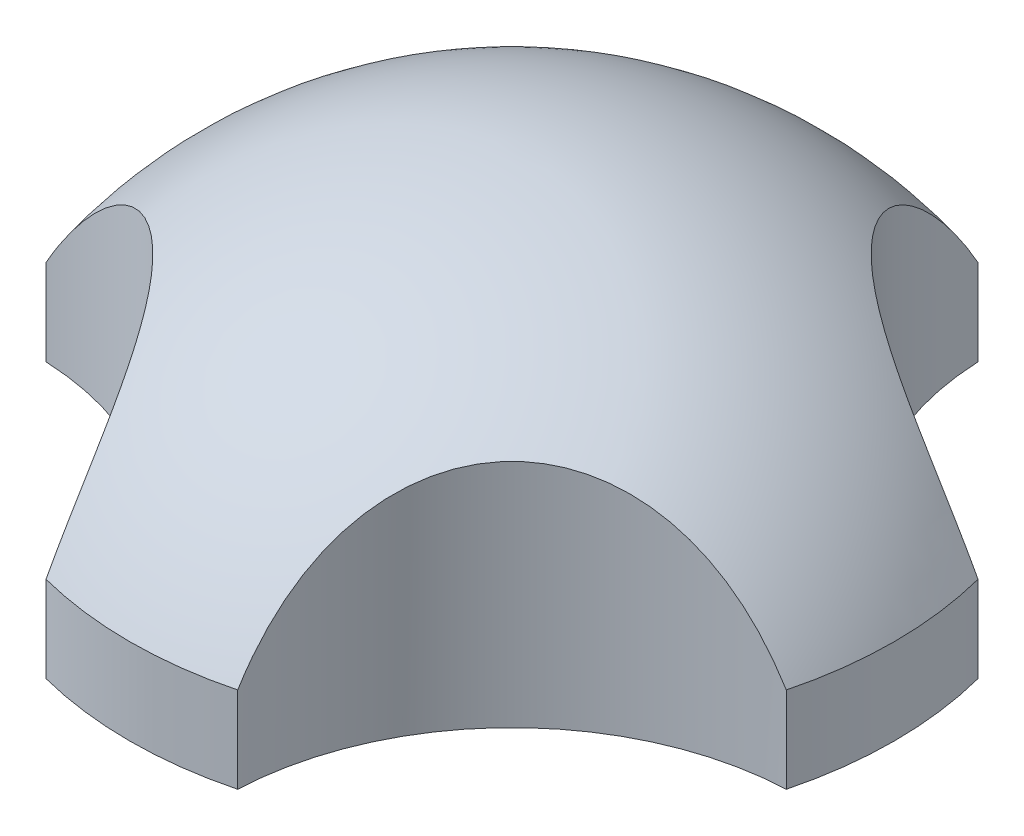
ISO-10303-21;
HEADER;
FILE_DESCRIPTION(('STEP AP214'),'2;1');
FILE_NAME('part.step','',(''),(''),'','','');
FILE_SCHEMA(('AUTOMOTIVE_DESIGN { 1 0 10303 214 1 1 1 1 }'));
ENDSEC;
DATA;
#1=APPLICATION_CONTEXT('core data for automotive mechanical design processes');
#2=APPLICATION_PROTOCOL_DEFINITION('international standard','automotive_design',2000,#1);
#3=PRODUCT_CONTEXT('',#1,'mechanical');
#4=PRODUCT('Part','Part','',(#3));
#5=PRODUCT_RELATED_PRODUCT_CATEGORY('part','',(#4));
#6=PRODUCT_DEFINITION_FORMATION('','',#4);
#7=PRODUCT_DEFINITION_CONTEXT('part definition',#1,'design');
#8=PRODUCT_DEFINITION('design','',#6,#7);
#9=PRODUCT_DEFINITION_SHAPE('','',#8);
#10=(LENGTH_UNIT() NAMED_UNIT(*) SI_UNIT(.MILLI.,.METRE.));
#11=(NAMED_UNIT(*) PLANE_ANGLE_UNIT() SI_UNIT($,.RADIAN.));
#12=(NAMED_UNIT(*) SI_UNIT($,.STERADIAN.) SOLID_ANGLE_UNIT());
#13=UNCERTAINTY_MEASURE_WITH_UNIT(LENGTH_MEASURE(1.E-05),#10,'distance_accuracy_value','');
#14=(GEOMETRIC_REPRESENTATION_CONTEXT(3) GLOBAL_UNCERTAINTY_ASSIGNED_CONTEXT((#13)) GLOBAL_UNIT_ASSIGNED_CONTEXT((#10,
#11,#12)) REPRESENTATION_CONTEXT('',''));
#15=CARTESIAN_POINT('',(0.,0.,0.));
#16=DIRECTION('',(0.,0.,1.));
#17=DIRECTION('',(1.,0.,0.));
#18=AXIS2_PLACEMENT_3D('',#15,#16,#17);
#19=CARTESIAN_POINT('',(0.,0.,0.));
#20=DIRECTION('',(0.,1.,0.));
#21=DIRECTION('',(1.,0.,0.));
#22=AXIS2_PLACEMENT_3D('',#19,#20,#21);
#23=SPHERICAL_SURFACE('',#22,45.6508488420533);
#24=CARTESIAN_POINT('',(0.,22.,0.));
#25=DIRECTION('',(0.,1.,0.));
#26=DIRECTION('',(0.,0.,1.));
#27=AXIS2_PLACEMENT_3D('',#24,#25,#26);
#28=CIRCLE('',#27,40.);
#29=CARTESIAN_POINT('',(10.0271996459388,22.,-38.7228003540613));
#30=VERTEX_POINT('',#29);
#31=CARTESIAN_POINT('',(-10.0271996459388,22.,-38.7228003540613));
#32=VERTEX_POINT('',#31);
#33=EDGE_CURVE('E122',#30,#32,#28,.T.);
#34=ORIENTED_EDGE('',*,*,#33,.T.);
#35=CARTESIAN_POINT('',(-38.7229152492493,21.9998,-10.0271947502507));
#36=CARTESIAN_POINT('',(-38.5161388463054,22.3597377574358,-10.0360110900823));
#37=CARTESIAN_POINT('',(-38.3039032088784,22.7164535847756,-10.0471913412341));
#38=CARTESIAN_POINT('',(-37.8685647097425,23.4230293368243,-10.0750164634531));
#39=CARTESIAN_POINT('',(-37.6454605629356,23.7728884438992,-10.0916619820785));
#40=CARTESIAN_POINT('',(-36.9593493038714,24.8124179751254,-10.1509540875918));
#41=CARTESIAN_POINT('',(-36.4801306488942,25.4910164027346,-10.2029354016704));
#42=CARTESIAN_POINT('',(-35.4746718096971,26.8209325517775,-10.3388874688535));
#43=CARTESIAN_POINT('',(-34.9479732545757,27.4718690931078,-10.4232030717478));
#44=CARTESIAN_POINT('',(-33.8547317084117,28.7323405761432,-10.6308845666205));
#45=CARTESIAN_POINT('',(-33.288215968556,29.3419032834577,-10.7542239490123));
#46=CARTESIAN_POINT('',(-32.2580200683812,30.373577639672,-11.0125437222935));
#47=CARTESIAN_POINT('',(-31.8019654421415,30.8057679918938,-11.137762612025));
#48=CARTESIAN_POINT('',(-30.8708251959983,31.638850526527,-11.4186318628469));
#49=CARTESIAN_POINT('',(-30.3957387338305,32.039741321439,-11.5742835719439));
#50=CARTESIAN_POINT('',(-29.431383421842,32.8046895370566,-11.9185929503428));
#51=CARTESIAN_POINT('',(-28.9421781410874,33.1688864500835,-12.1071175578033));
#52=CARTESIAN_POINT('',(-27.9515107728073,33.8578811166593,-12.5205212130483));
#53=CARTESIAN_POINT('',(-27.4500515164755,34.1826878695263,-12.7453919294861));
#54=CARTESIAN_POINT('',(-26.5373420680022,34.7296584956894,-13.1865390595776));
#55=CARTESIAN_POINT('',(-26.1274244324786,34.9595195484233,-13.3960495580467));
#56=CARTESIAN_POINT('',(-25.3054890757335,35.3881508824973,-13.8410698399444));
#57=CARTESIAN_POINT('',(-24.8934718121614,35.5869276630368,-14.0765741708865));
#58=CARTESIAN_POINT('',(-24.0703818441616,35.9510506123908,-14.5740575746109));
#59=CARTESIAN_POINT('',(-23.6593094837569,36.1163860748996,-14.8360450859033));
#60=CARTESIAN_POINT('',(-22.8418052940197,36.4112783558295,-15.3862019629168));
#61=CARTESIAN_POINT('',(-22.4353735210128,36.5408347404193,-15.6743716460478));
#62=CARTESIAN_POINT('',(-21.6286710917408,36.7628320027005,-16.2776615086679));
#63=CARTESIAN_POINT('',(-21.2284483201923,36.8550586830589,-16.5929249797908));
#64=CARTESIAN_POINT('',(-20.4404525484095,36.9998216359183,-17.2472782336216));
#65=CARTESIAN_POINT('',(-20.052679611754,37.0523577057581,-17.5863681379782));
#66=CARTESIAN_POINT('',(-19.2935005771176,37.1168190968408,-18.2857842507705));
#67=CARTESIAN_POINT('',(-18.9220883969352,37.1287596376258,-18.6461024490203));
#68=CARTESIAN_POINT('',(-18.1988932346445,37.1118576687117,-19.3849830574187));
#69=CARTESIAN_POINT('',(-17.8471088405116,37.0830180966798,-19.7635441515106));
#70=CARTESIAN_POINT('',(-17.1985788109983,36.9897647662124,-20.4984111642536));
#71=CARTESIAN_POINT('',(-16.899786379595,36.9290148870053,-20.8533855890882));
#72=CARTESIAN_POINT('',(-16.3221839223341,36.7754424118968,-21.5724751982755));
#73=CARTESIAN_POINT('',(-16.043372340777,36.6826223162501,-21.9365896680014));
#74=CARTESIAN_POINT('',(-15.5068160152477,36.4661287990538,-22.6710982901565));
#75=CARTESIAN_POINT('',(-15.2490722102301,36.3424540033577,-23.0414927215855));
#76=CARTESIAN_POINT('',(-14.755254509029,36.0657698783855,-23.7857375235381));
#77=CARTESIAN_POINT('',(-14.5191817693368,35.9127589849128,-24.1595880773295));
#78=CARTESIAN_POINT('',(-14.0596184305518,35.5722820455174,-24.9234176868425));
#79=CARTESIAN_POINT('',(-13.8370404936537,35.3836605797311,-25.3134295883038));
#80=CARTESIAN_POINT('',(-13.4152181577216,34.9785702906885,-26.0915396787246));
#81=CARTESIAN_POINT('',(-13.2159737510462,34.7621014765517,-26.4796378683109));
#82=CARTESIAN_POINT('',(-12.840076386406,34.303383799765,-27.2515541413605));
#83=CARTESIAN_POINT('',(-12.6634264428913,34.0611315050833,-27.6353716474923));
#84=CARTESIAN_POINT('',(-12.3317135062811,33.5529111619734,-28.3966211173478));
#85=CARTESIAN_POINT('',(-12.1766551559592,33.286938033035,-28.7740516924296));
#86=CARTESIAN_POINT('',(-11.81242694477,32.5908661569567,-29.7127101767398));
#87=CARTESIAN_POINT('',(-11.6164209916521,32.1466877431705,-30.268672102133));
#88=CARTESIAN_POINT('',(-11.2663380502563,31.214753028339,-31.3568677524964));
#89=CARTESIAN_POINT('',(-11.1122805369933,30.7269766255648,-31.8890903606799));
#90=CARTESIAN_POINT('',(-10.840640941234,29.7121005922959,-32.9274753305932));
#91=CARTESIAN_POINT('',(-10.7231644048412,29.1848925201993,-33.4335588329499));
#92=CARTESIAN_POINT('',(-10.5201414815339,28.0973737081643,-34.4152726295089));
#93=CARTESIAN_POINT('',(-10.434587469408,27.5370709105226,-34.8909101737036));
#94=CARTESIAN_POINT('',(-10.3134325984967,26.5710978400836,-35.6631922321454));
#95=CARTESIAN_POINT('',(-10.2706041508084,26.1731780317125,-35.9684965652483));
#96=CARTESIAN_POINT('',(-10.1959357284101,25.3650782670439,-36.5637644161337));
#97=CARTESIAN_POINT('',(-10.164094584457,24.9548996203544,-36.8537295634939));
#98=CARTESIAN_POINT('',(-10.1101688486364,24.126325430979,-37.4159654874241));
#99=CARTESIAN_POINT('',(-10.0880154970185,23.7080105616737,-37.6883488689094));
#100=CARTESIAN_POINT('',(-10.0518355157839,22.861266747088,-38.2174401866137));
#101=CARTESIAN_POINT('',(-10.0378084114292,22.4328383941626,-38.4741490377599));
#102=CARTESIAN_POINT('',(-10.0271947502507,21.9998,-38.7229152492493));
#103=B_SPLINE_CURVE_WITH_KNOTS('',3,(#35,#36,#37,#38,#39,#40,#41,#42,#43,#44,#45,#46,#47,#48,
#49,#50,#51,#52,#53,#54,#55,#56,#57,#58,#59,#60,#61,#62,#63,#64,#65,#66,#67,#68,#69,#70,#71,#72,
#73,#74,#75,#76,#77,#78,#79,#80,#81,#82,#83,#84,#85,#86,#87,#88,#89,#90,#91,#92,#93,#94,#95,#96,
#97,#98,#99,#100,#101,#102),.UNSPECIFIED.,.F.,.F.,(4,2,2,2,2,2,2,2,2,2,2,2,2,2,2,2,2,2,2,2,2,2,
2,2,2,2,2,2,2,2,2,2,2,4),(0.,1.24548237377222,2.49111237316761,4.98590737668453,
7.50808492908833,10.0285527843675,11.9489879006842,13.8695081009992,15.7824276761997,
17.6949093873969,19.2371004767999,20.778968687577,22.321329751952,23.8637095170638,
25.4148180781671,26.9659345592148,28.5164694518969,30.0668926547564,31.4691175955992,
32.8712332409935,34.2734113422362,35.6756642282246,37.1354075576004,38.5951504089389,
40.0550878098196,41.5153386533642,43.7263169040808,45.9383198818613,48.156647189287,
50.3744442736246,51.8840947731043,53.393584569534,54.8921795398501,56.3906869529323),.UNSPECIFIED.);
#104=CARTESIAN_POINT('',(-38.7228003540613,22.,-10.0271996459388));
#105=VERTEX_POINT('',#104);
#106=EDGE_CURVE('E58',#105,#32,#103,.T.);
#107=ORIENTED_EDGE('',*,*,#106,.F.);
#108=CARTESIAN_POINT('',(-38.7228003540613,22.,10.0271996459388));
#109=VERTEX_POINT('',#108);
#110=EDGE_CURVE('E119',#105,#109,#28,.T.);
#111=ORIENTED_EDGE('',*,*,#110,.T.);
#112=CARTESIAN_POINT('',(-10.0271947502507,21.9998,38.7229152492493));
#113=CARTESIAN_POINT('',(-10.0360110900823,22.3597377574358,38.5161388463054));
#114=CARTESIAN_POINT('',(-10.0471913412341,22.7164535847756,38.3039032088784));
#115=CARTESIAN_POINT('',(-10.0750164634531,23.4230293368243,37.8685647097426));
#116=CARTESIAN_POINT('',(-10.0916619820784,23.7728884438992,37.6454605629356));
#117=CARTESIAN_POINT('',(-10.1509540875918,24.8124179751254,36.9593493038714));
#118=CARTESIAN_POINT('',(-10.2029354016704,25.4910164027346,36.4801306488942));
#119=CARTESIAN_POINT('',(-10.3388874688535,26.8209325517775,35.4746718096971));
#120=CARTESIAN_POINT('',(-10.4232030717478,27.4718690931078,34.9479732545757));
#121=CARTESIAN_POINT('',(-10.6308845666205,28.7323405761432,33.8547317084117));
#122=CARTESIAN_POINT('',(-10.7542239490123,29.3419032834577,33.2882159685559));
#123=CARTESIAN_POINT('',(-11.0125437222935,30.373577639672,32.2580200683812));
#124=CARTESIAN_POINT('',(-11.137762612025,30.8057679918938,31.8019654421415));
#125=CARTESIAN_POINT('',(-11.4186318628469,31.638850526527,30.8708251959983));
#126=CARTESIAN_POINT('',(-11.5742835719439,32.039741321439,30.3957387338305));
#127=CARTESIAN_POINT('',(-11.9185929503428,32.8046895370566,29.431383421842));
#128=CARTESIAN_POINT('',(-12.1071175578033,33.1688864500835,28.9421781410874));
#129=CARTESIAN_POINT('',(-12.5205212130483,33.8578811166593,27.9515107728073));
#130=CARTESIAN_POINT('',(-12.7453919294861,34.1826878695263,27.4500515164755));
#131=CARTESIAN_POINT('',(-13.1865390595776,34.7296584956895,26.5373420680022));
#132=CARTESIAN_POINT('',(-13.3960495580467,34.9595195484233,26.1274244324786));
#133=CARTESIAN_POINT('',(-13.8410698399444,35.3881508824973,25.3054890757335));
#134=CARTESIAN_POINT('',(-14.0765741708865,35.5869276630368,24.8934718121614));
#135=CARTESIAN_POINT('',(-14.5740575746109,35.9510506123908,24.0703818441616));
#136=CARTESIAN_POINT('',(-14.8360450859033,36.1163860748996,23.6593094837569));
#137=CARTESIAN_POINT('',(-15.3862019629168,36.4112783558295,22.8418052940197));
#138=CARTESIAN_POINT('',(-15.6743716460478,36.5408347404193,22.4353735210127));
#139=CARTESIAN_POINT('',(-16.2776615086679,36.7628320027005,21.6286710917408));
#140=CARTESIAN_POINT('',(-16.5929249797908,36.8550586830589,21.2284483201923));
#141=CARTESIAN_POINT('',(-17.2472782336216,36.9998216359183,20.4404525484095));
#142=CARTESIAN_POINT('',(-17.5863681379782,37.0523577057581,20.0526796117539));
#143=CARTESIAN_POINT('',(-18.2857842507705,37.1168190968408,19.2935005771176));
#144=CARTESIAN_POINT('',(-18.6461024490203,37.1287596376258,18.9220883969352));
#145=CARTESIAN_POINT('',(-19.3849830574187,37.1118576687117,18.1988932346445));
#146=CARTESIAN_POINT('',(-19.7635441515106,37.0830180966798,17.8471088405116));
#147=CARTESIAN_POINT('',(-20.4984111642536,36.9897647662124,17.1985788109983));
#148=CARTESIAN_POINT('',(-20.8533855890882,36.9290148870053,16.899786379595));
#149=CARTESIAN_POINT('',(-21.5724751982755,36.7754424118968,16.3221839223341));
#150=CARTESIAN_POINT('',(-21.9365896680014,36.6826223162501,16.043372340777));
#151=CARTESIAN_POINT('',(-22.6710982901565,36.4661287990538,15.5068160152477));
#152=CARTESIAN_POINT('',(-23.0414927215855,36.3424540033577,15.2490722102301));
#153=CARTESIAN_POINT('',(-23.7857375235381,36.0657698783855,14.755254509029));
#154=CARTESIAN_POINT('',(-24.1595880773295,35.9127589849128,14.5191817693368));
#155=CARTESIAN_POINT('',(-24.9234176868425,35.5722820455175,14.0596184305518));
#156=CARTESIAN_POINT('',(-25.3134295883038,35.3836605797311,13.8370404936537));
#157=CARTESIAN_POINT('',(-26.0915396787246,34.9785702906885,13.4152181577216));
#158=CARTESIAN_POINT('',(-26.4796378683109,34.7621014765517,13.2159737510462));
#159=CARTESIAN_POINT('',(-27.2515541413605,34.303383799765,12.840076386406));
#160=CARTESIAN_POINT('',(-27.6353716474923,34.0611315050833,12.6634264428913));
#161=CARTESIAN_POINT('',(-28.3966211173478,33.5529111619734,12.3317135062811));
#162=CARTESIAN_POINT('',(-28.7740516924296,33.286938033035,12.1766551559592));
#163=CARTESIAN_POINT('',(-29.7127101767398,32.5908661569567,11.81242694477));
#164=CARTESIAN_POINT('',(-30.268672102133,32.1466877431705,11.6164209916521));
#165=CARTESIAN_POINT('',(-31.3568677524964,31.214753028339,11.2663380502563));
#166=CARTESIAN_POINT('',(-31.8890903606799,30.7269766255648,11.1122805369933));
#167=CARTESIAN_POINT('',(-32.9274753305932,29.7121005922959,10.840640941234));
#168=CARTESIAN_POINT('',(-33.4335588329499,29.1848925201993,10.7231644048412));
#169=CARTESIAN_POINT('',(-34.4152726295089,28.0973737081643,10.5201414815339));
#170=CARTESIAN_POINT('',(-34.8909101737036,27.5370709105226,10.4345874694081));
#171=CARTESIAN_POINT('',(-35.6631922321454,26.5710978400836,10.3134325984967));
#172=CARTESIAN_POINT('',(-35.9684965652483,26.1731780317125,10.2706041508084));
#173=CARTESIAN_POINT('',(-36.5637644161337,25.3650782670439,10.1959357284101));
#174=CARTESIAN_POINT('',(-36.8537295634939,24.9548996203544,10.164094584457));
#175=CARTESIAN_POINT('',(-37.4159654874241,24.126325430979,10.1101688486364));
#176=CARTESIAN_POINT('',(-37.6883488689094,23.7080105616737,10.0880154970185));
#177=CARTESIAN_POINT('',(-38.2174401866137,22.861266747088,10.0518355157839));
#178=CARTESIAN_POINT('',(-38.4741490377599,22.4328383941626,10.0378084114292));
#179=CARTESIAN_POINT('',(-38.7229152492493,21.9998,10.0271947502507));
#180=B_SPLINE_CURVE_WITH_KNOTS('',3,(#112,#113,#114,#115,#116,#117,#118,#119,#120,#121,#122,
#123,#124,#125,#126,#127,#128,#129,#130,#131,#132,#133,#134,#135,#136,#137,#138,#139,#140,#141,
#142,#143,#144,#145,#146,#147,#148,#149,#150,#151,#152,#153,#154,#155,#156,#157,#158,#159,#160,
#161,#162,#163,#164,#165,#166,#167,#168,#169,#170,#171,#172,#173,#174,#175,#176,#177,#178,#179),
.UNSPECIFIED.,.F.,.F.,(4,2,2,2,2,2,2,2,2,2,2,2,2,2,2,2,2,2,2,2,2,2,2,2,2,2,2,2,2,2,2,2,2,4),(0.,
1.24548237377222,2.49111237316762,4.98590737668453,7.50808492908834,10.0285527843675,
11.9489879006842,13.8695081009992,15.7824276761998,17.694909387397,19.2371004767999,
20.778968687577,22.321329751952,23.8637095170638,25.4148180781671,26.9659345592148,
28.5164694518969,30.0668926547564,31.4691175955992,32.8712332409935,34.2734113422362,
35.6756642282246,37.1354075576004,38.5951504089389,40.0550878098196,41.5153386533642,
43.7263169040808,45.9383198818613,48.156647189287,50.3744442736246,51.8840947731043,
53.3935845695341,54.8921795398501,56.3906869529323),.UNSPECIFIED.);
#181=CARTESIAN_POINT('',(-10.0271996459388,22.,38.7228003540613));
#182=VERTEX_POINT('',#181);
#183=EDGE_CURVE('E197',#182,#109,#180,.T.);
#184=ORIENTED_EDGE('',*,*,#183,.F.);
#185=CARTESIAN_POINT('',(10.0271996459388,22.,38.7228003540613));
#186=VERTEX_POINT('',#185);
#187=EDGE_CURVE('E130',#182,#186,#28,.T.);
#188=ORIENTED_EDGE('',*,*,#187,.T.);
#189=CARTESIAN_POINT('',(38.7229152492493,21.9998,10.0271947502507));
#190=CARTESIAN_POINT('',(38.5161388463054,22.3597377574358,10.0360110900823));
#191=CARTESIAN_POINT('',(38.3039032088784,22.7164535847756,10.0471913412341));
#192=CARTESIAN_POINT('',(37.8685647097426,23.4230293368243,10.0750164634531));
#193=CARTESIAN_POINT('',(37.6454605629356,23.7728884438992,10.0916619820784));
#194=CARTESIAN_POINT('',(36.9593493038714,24.8124179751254,10.1509540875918));
#195=CARTESIAN_POINT('',(36.4801306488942,25.4910164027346,10.2029354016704));
#196=CARTESIAN_POINT('',(35.4746718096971,26.8209325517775,10.3388874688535));
#197=CARTESIAN_POINT('',(34.9479732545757,27.4718690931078,10.4232030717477));
#198=CARTESIAN_POINT('',(33.8547317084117,28.7323405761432,10.6308845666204));
#199=CARTESIAN_POINT('',(33.288215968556,29.3419032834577,10.7542239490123));
#200=CARTESIAN_POINT('',(32.2580200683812,30.373577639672,11.0125437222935));
#201=CARTESIAN_POINT('',(31.8019654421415,30.8057679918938,11.137762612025));
#202=CARTESIAN_POINT('',(30.8708251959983,31.638850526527,11.4186318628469));
#203=CARTESIAN_POINT('',(30.3957387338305,32.039741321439,11.5742835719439));
#204=CARTESIAN_POINT('',(29.431383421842,32.8046895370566,11.9185929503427));
#205=CARTESIAN_POINT('',(28.9421781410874,33.1688864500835,12.1071175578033));
#206=CARTESIAN_POINT('',(27.9515107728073,33.8578811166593,12.5205212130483));
#207=CARTESIAN_POINT('',(27.4500515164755,34.1826878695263,12.7453919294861));
#208=CARTESIAN_POINT('',(26.5373420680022,34.7296584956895,13.1865390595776));
#209=CARTESIAN_POINT('',(26.1274244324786,34.9595195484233,13.3960495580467));
#210=CARTESIAN_POINT('',(25.3054890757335,35.3881508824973,13.8410698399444));
#211=CARTESIAN_POINT('',(24.8934718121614,35.5869276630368,14.0765741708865));
#212=CARTESIAN_POINT('',(24.0703818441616,35.9510506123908,14.5740575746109));
#213=CARTESIAN_POINT('',(23.6593094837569,36.1163860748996,14.8360450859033));
#214=CARTESIAN_POINT('',(22.8418052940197,36.4112783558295,15.3862019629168));
#215=CARTESIAN_POINT('',(22.4353735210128,36.5408347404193,15.6743716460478));
#216=CARTESIAN_POINT('',(21.6286710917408,36.7628320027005,16.2776615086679));
#217=CARTESIAN_POINT('',(21.2284483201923,36.8550586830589,16.5929249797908));
#218=CARTESIAN_POINT('',(20.4404525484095,36.9998216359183,17.2472782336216));
#219=CARTESIAN_POINT('',(20.0526796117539,37.0523577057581,17.5863681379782));
#220=CARTESIAN_POINT('',(19.2935005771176,37.1168190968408,18.2857842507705));
#221=CARTESIAN_POINT('',(18.9220883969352,37.1287596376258,18.6461024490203));
#222=CARTESIAN_POINT('',(18.1988932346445,37.1118576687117,19.3849830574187));
#223=CARTESIAN_POINT('',(17.8471088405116,37.0830180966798,19.7635441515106));
#224=CARTESIAN_POINT('',(17.1985788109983,36.9897647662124,20.4984111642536));
#225=CARTESIAN_POINT('',(16.899786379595,36.9290148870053,20.8533855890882));
#226=CARTESIAN_POINT('',(16.3221839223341,36.7754424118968,21.5724751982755));
#227=CARTESIAN_POINT('',(16.043372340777,36.6826223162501,21.9365896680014));
#228=CARTESIAN_POINT('',(15.5068160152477,36.4661287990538,22.6710982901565));
#229=CARTESIAN_POINT('',(15.2490722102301,36.3424540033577,23.0414927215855));
#230=CARTESIAN_POINT('',(14.755254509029,36.0657698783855,23.7857375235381));
#231=CARTESIAN_POINT('',(14.5191817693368,35.9127589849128,24.1595880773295));
#232=CARTESIAN_POINT('',(14.0596184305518,35.5722820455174,24.9234176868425));
#233=CARTESIAN_POINT('',(13.8370404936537,35.3836605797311,25.3134295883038));
#234=CARTESIAN_POINT('',(13.4152181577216,34.9785702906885,26.0915396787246));
#235=CARTESIAN_POINT('',(13.2159737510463,34.7621014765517,26.4796378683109));
#236=CARTESIAN_POINT('',(12.840076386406,34.303383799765,27.2515541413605));
#237=CARTESIAN_POINT('',(12.6634264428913,34.0611315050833,27.6353716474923));
#238=CARTESIAN_POINT('',(12.3317135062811,33.5529111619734,28.3966211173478));
#239=CARTESIAN_POINT('',(12.1766551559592,33.286938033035,28.7740516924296));
#240=CARTESIAN_POINT('',(11.81242694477,32.5908661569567,29.7127101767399));
#241=CARTESIAN_POINT('',(11.6164209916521,32.1466877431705,30.268672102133));
#242=CARTESIAN_POINT('',(11.2663380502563,31.214753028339,31.3568677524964));
#243=CARTESIAN_POINT('',(11.1122805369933,30.7269766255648,31.8890903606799));
#244=CARTESIAN_POINT('',(10.840640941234,29.7121005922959,32.9274753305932));
#245=CARTESIAN_POINT('',(10.7231644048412,29.1848925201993,33.4335588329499));
#246=CARTESIAN_POINT('',(10.5201414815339,28.0973737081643,34.4152726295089));
#247=CARTESIAN_POINT('',(10.4345874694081,27.5370709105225,34.8909101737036));
#248=CARTESIAN_POINT('',(10.3134325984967,26.5710978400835,35.6631922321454));
#249=CARTESIAN_POINT('',(10.2706041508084,26.1731780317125,35.9684965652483));
#250=CARTESIAN_POINT('',(10.1959357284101,25.3650782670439,36.5637644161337));
#251=CARTESIAN_POINT('',(10.164094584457,24.9548996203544,36.8537295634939));
#252=CARTESIAN_POINT('',(10.1101688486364,24.1263254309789,37.4159654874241));
#253=CARTESIAN_POINT('',(10.0880154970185,23.7080105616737,37.6883488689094));
#254=CARTESIAN_POINT('',(10.0518355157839,22.861266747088,38.2174401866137));
#255=CARTESIAN_POINT('',(10.0378084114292,22.4328383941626,38.4741490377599));
#256=CARTESIAN_POINT('',(10.0271947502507,21.9998,38.7229152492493));
#257=B_SPLINE_CURVE_WITH_KNOTS('',3,(#189,#190,#191,#192,#193,#194,#195,#196,#197,#198,#199,
#200,#201,#202,#203,#204,#205,#206,#207,#208,#209,#210,#211,#212,#213,#214,#215,#216,#217,#218,
#219,#220,#221,#222,#223,#224,#225,#226,#227,#228,#229,#230,#231,#232,#233,#234,#235,#236,#237,
#238,#239,#240,#241,#242,#243,#244,#245,#246,#247,#248,#249,#250,#251,#252,#253,#254,#255,#256),
.UNSPECIFIED.,.F.,.F.,(4,2,2,2,2,2,2,2,2,2,2,2,2,2,2,2,2,2,2,2,2,2,2,2,2,2,2,2,2,2,2,2,2,4),(0.,
1.24548237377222,2.49111237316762,4.98590737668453,7.50808492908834,10.0285527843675,
11.9489879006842,13.8695081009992,15.7824276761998,17.6949093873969,19.2371004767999,
20.778968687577,22.321329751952,23.8637095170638,25.4148180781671,26.9659345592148,
28.5164694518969,30.0668926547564,31.4691175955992,32.8712332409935,34.2734113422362,
35.6756642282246,37.1354075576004,38.5951504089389,40.0550878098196,41.5153386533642,
43.7263169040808,45.9383198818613,48.156647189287,50.3744442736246,51.8840947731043,
53.3935845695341,54.8921795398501,56.3906869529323),.UNSPECIFIED.);
#258=CARTESIAN_POINT('',(38.7228003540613,22.,10.0271996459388));
#259=VERTEX_POINT('',#258);
#260=EDGE_CURVE('E214',#259,#186,#257,.T.);
#261=ORIENTED_EDGE('',*,*,#260,.F.);
#262=CARTESIAN_POINT('',(38.7228003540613,22.,-10.0271996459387));
#263=VERTEX_POINT('',#262);
#264=EDGE_CURVE('E132',#259,#263,#28,.T.);
#265=ORIENTED_EDGE('',*,*,#264,.T.);
#266=CARTESIAN_POINT('',(10.0271947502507,21.9998,-38.7229152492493));
#267=CARTESIAN_POINT('',(10.0360110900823,22.3597377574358,-38.5161388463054));
#268=CARTESIAN_POINT('',(10.0471913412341,22.7164535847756,-38.3039032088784));
#269=CARTESIAN_POINT('',(10.0750164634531,23.4230293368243,-37.8685647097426));
#270=CARTESIAN_POINT('',(10.0916619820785,23.7728884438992,-37.6454605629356));
#271=CARTESIAN_POINT('',(10.1509540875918,24.8124179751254,-36.9593493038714));
#272=CARTESIAN_POINT('',(10.2029354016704,25.4910164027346,-36.4801306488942));
#273=CARTESIAN_POINT('',(10.3388874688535,26.8209325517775,-35.4746718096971));
#274=CARTESIAN_POINT('',(10.4232030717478,27.4718690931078,-34.9479732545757));
#275=CARTESIAN_POINT('',(10.6308845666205,28.7323405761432,-33.8547317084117));
#276=CARTESIAN_POINT('',(10.7542239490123,29.3419032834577,-33.2882159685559));
#277=CARTESIAN_POINT('',(11.0125437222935,30.373577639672,-32.2580200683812));
#278=CARTESIAN_POINT('',(11.137762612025,30.8057679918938,-31.8019654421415));
#279=CARTESIAN_POINT('',(11.4186318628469,31.638850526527,-30.8708251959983));
#280=CARTESIAN_POINT('',(11.5742835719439,32.039741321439,-30.3957387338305));
#281=CARTESIAN_POINT('',(11.9185929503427,32.8046895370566,-29.431383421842));
#282=CARTESIAN_POINT('',(12.1071175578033,33.1688864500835,-28.9421781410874));
#283=CARTESIAN_POINT('',(12.5205212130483,33.8578811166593,-27.9515107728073));
#284=CARTESIAN_POINT('',(12.7453919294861,34.1826878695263,-27.4500515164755));
#285=CARTESIAN_POINT('',(13.1865390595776,34.7296584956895,-26.5373420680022));
#286=CARTESIAN_POINT('',(13.3960495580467,34.9595195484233,-26.1274244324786));
#287=CARTESIAN_POINT('',(13.8410698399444,35.3881508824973,-25.3054890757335));
#288=CARTESIAN_POINT('',(14.0765741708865,35.5869276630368,-24.8934718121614));
#289=CARTESIAN_POINT('',(14.5740575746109,35.9510506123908,-24.0703818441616));
#290=CARTESIAN_POINT('',(14.8360450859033,36.1163860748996,-23.6593094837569));
#291=CARTESIAN_POINT('',(15.3862019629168,36.4112783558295,-22.8418052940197));
#292=CARTESIAN_POINT('',(15.6743716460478,36.5408347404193,-22.4353735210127));
#293=CARTESIAN_POINT('',(16.2776615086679,36.7628320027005,-21.6286710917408));
#294=CARTESIAN_POINT('',(16.5929249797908,36.8550586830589,-21.2284483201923));
#295=CARTESIAN_POINT('',(17.2472782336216,36.9998216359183,-20.4404525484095));
#296=CARTESIAN_POINT('',(17.5863681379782,37.0523577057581,-20.0526796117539));
#297=CARTESIAN_POINT('',(18.2857842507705,37.1168190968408,-19.2935005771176));
#298=CARTESIAN_POINT('',(18.6461024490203,37.1287596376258,-18.9220883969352));
#299=CARTESIAN_POINT('',(19.3849830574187,37.1118576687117,-18.1988932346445));
#300=CARTESIAN_POINT('',(19.7635441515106,37.0830180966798,-17.8471088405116));
#301=CARTESIAN_POINT('',(20.4984111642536,36.9897647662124,-17.1985788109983));
#302=CARTESIAN_POINT('',(20.8533855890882,36.9290148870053,-16.899786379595));
#303=CARTESIAN_POINT('',(21.5724751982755,36.7754424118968,-16.3221839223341));
#304=CARTESIAN_POINT('',(21.9365896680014,36.6826223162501,-16.043372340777));
#305=CARTESIAN_POINT('',(22.6710982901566,36.4661287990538,-15.5068160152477));
#306=CARTESIAN_POINT('',(23.0414927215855,36.3424540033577,-15.2490722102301));
#307=CARTESIAN_POINT('',(23.7857375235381,36.0657698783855,-14.755254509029));
#308=CARTESIAN_POINT('',(24.1595880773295,35.9127589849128,-14.5191817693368));
#309=CARTESIAN_POINT('',(24.9234176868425,35.5722820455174,-14.0596184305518));
#310=CARTESIAN_POINT('',(25.3134295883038,35.3836605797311,-13.8370404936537));
#311=CARTESIAN_POINT('',(26.0915396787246,34.9785702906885,-13.4152181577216));
#312=CARTESIAN_POINT('',(26.4796378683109,34.7621014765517,-13.2159737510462));
#313=CARTESIAN_POINT('',(27.2515541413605,34.303383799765,-12.840076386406));
#314=CARTESIAN_POINT('',(27.6353716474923,34.0611315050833,-12.6634264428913));
#315=CARTESIAN_POINT('',(28.3966211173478,33.5529111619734,-12.3317135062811));
#316=CARTESIAN_POINT('',(28.7740516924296,33.286938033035,-12.1766551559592));
#317=CARTESIAN_POINT('',(29.7127101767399,32.5908661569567,-11.8124269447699));
#318=CARTESIAN_POINT('',(30.268672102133,32.1466877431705,-11.6164209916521));
#319=CARTESIAN_POINT('',(31.3568677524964,31.214753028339,-11.2663380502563));
#320=CARTESIAN_POINT('',(31.8890903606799,30.7269766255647,-11.1122805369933));
#321=CARTESIAN_POINT('',(32.9274753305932,29.7121005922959,-10.840640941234));
#322=CARTESIAN_POINT('',(33.4335588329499,29.1848925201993,-10.7231644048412));
#323=CARTESIAN_POINT('',(34.4152726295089,28.0973737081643,-10.5201414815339));
#324=CARTESIAN_POINT('',(34.8909101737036,27.5370709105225,-10.434587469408));
#325=CARTESIAN_POINT('',(35.6631922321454,26.5710978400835,-10.3134325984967));
#326=CARTESIAN_POINT('',(35.9684965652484,26.1731780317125,-10.2706041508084));
#327=CARTESIAN_POINT('',(36.5637644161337,25.3650782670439,-10.1959357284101));
#328=CARTESIAN_POINT('',(36.8537295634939,24.9548996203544,-10.164094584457));
#329=CARTESIAN_POINT('',(37.4159654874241,24.126325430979,-10.1101688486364));
#330=CARTESIAN_POINT('',(37.6883488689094,23.7080105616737,-10.0880154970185));
#331=CARTESIAN_POINT('',(38.2174401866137,22.861266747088,-10.0518355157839));
#332=CARTESIAN_POINT('',(38.4741490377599,22.4328383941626,-10.0378084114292));
#333=CARTESIAN_POINT('',(38.7229152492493,21.9998,-10.0271947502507));
#334=B_SPLINE_CURVE_WITH_KNOTS('',3,(#266,#267,#268,#269,#270,#271,#272,#273,#274,#275,#276,
#277,#278,#279,#280,#281,#282,#283,#284,#285,#286,#287,#288,#289,#290,#291,#292,#293,#294,#295,
#296,#297,#298,#299,#300,#301,#302,#303,#304,#305,#306,#307,#308,#309,#310,#311,#312,#313,#314,
#315,#316,#317,#318,#319,#320,#321,#322,#323,#324,#325,#326,#327,#328,#329,#330,#331,#332,#333),
.UNSPECIFIED.,.F.,.F.,(4,2,2,2,2,2,2,2,2,2,2,2,2,2,2,2,2,2,2,2,2,2,2,2,2,2,2,2,2,2,2,2,2,4),(0.,
1.24548237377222,2.49111237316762,4.98590737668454,7.50808492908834,10.0285527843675,
11.9489879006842,13.8695081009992,15.7824276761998,17.6949093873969,19.2371004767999,
20.778968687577,22.321329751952,23.8637095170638,25.4148180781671,26.9659345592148,
28.5164694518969,30.0668926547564,31.4691175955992,32.8712332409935,34.2734113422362,
35.6756642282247,37.1354075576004,38.5951504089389,40.0550878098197,41.5153386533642,
43.7263169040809,45.9383198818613,48.156647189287,50.3744442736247,51.8840947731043,
53.3935845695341,54.8921795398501,56.3906869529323),.UNSPECIFIED.);
#335=EDGE_CURVE('E66',#30,#263,#334,.T.);
#336=ORIENTED_EDGE('',*,*,#335,.F.);
#337=EDGE_LOOP('',(#34,#107,#111,#184,#188,#261,#265,#336));
#338=FACE_BOUND('',#337,.T.);
#339=ADVANCED_FACE('F43',(#338),#23,.T.);
#340=CARTESIAN_POINT('',(-40.,13.,0.));
#341=DIRECTION('',(0.,-1.,0.));
#342=DIRECTION('',(0.,0.,-1.));
#343=AXIS2_PLACEMENT_3D('',#340,#341,#342);
#344=PLANE('',#343);
#345=CARTESIAN_POINT('',(0.,13.,0.));
#346=DIRECTION('',(0.,1.,0.));
#347=DIRECTION('',(0.,0.,1.));
#348=AXIS2_PLACEMENT_3D('',#345,#346,#347);
#349=CIRCLE('',#348,19.);
#350=CARTESIAN_POINT('',(0.,13.,19.));
#351=VERTEX_POINT('',#350);
#352=EDGE_CURVE('E51',#351,#351,#349,.T.);
#353=ORIENTED_EDGE('',*,*,#352,.T.);
#354=EDGE_LOOP('',(#353));
#355=FACE_BOUND('',#354,.T.);
#356=CARTESIAN_POINT('',(0.,13.,0.));
#357=DIRECTION('',(0.,1.,0.));
#358=DIRECTION('',(0.,0.,1.));
#359=AXIS2_PLACEMENT_3D('',#356,#357,#358);
#360=CIRCLE('',#359,40.);
#361=CARTESIAN_POINT('',(-38.7228003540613,13.,-10.0271996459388));
#362=VERTEX_POINT('',#361);
#363=CARTESIAN_POINT('',(-38.7228003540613,13.,10.0271996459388));
#364=VERTEX_POINT('',#363);
#365=EDGE_CURVE('E144',#362,#364,#360,.T.);
#366=ORIENTED_EDGE('',*,*,#365,.F.);
#367=CARTESIAN_POINT('',(-40.,13.,-40.));
#368=DIRECTION('',(0.,-1.,0.));
#369=DIRECTION('',(0.,0.,-1.));
#370=AXIS2_PLACEMENT_3D('',#367,#368,#369);
#371=CIRCLE('',#370,30.);
#372=CARTESIAN_POINT('',(-10.0271996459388,13.,-38.7228003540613));
#373=VERTEX_POINT('',#372);
#374=EDGE_CURVE('E109',#362,#373,#371,.F.);
#375=ORIENTED_EDGE('',*,*,#374,.T.);
#376=CARTESIAN_POINT('',(10.0271996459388,13.,-38.7228003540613));
#377=VERTEX_POINT('',#376);
#378=EDGE_CURVE('E146',#377,#373,#360,.T.);
#379=ORIENTED_EDGE('',*,*,#378,.F.);
#380=CARTESIAN_POINT('',(40.,13.,-40.));
#381=DIRECTION('',(0.,-1.,0.));
#382=DIRECTION('',(0.,0.,-1.));
#383=AXIS2_PLACEMENT_3D('',#380,#381,#382);
#384=CIRCLE('',#383,30.);
#385=CARTESIAN_POINT('',(38.7228003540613,13.,-10.0271996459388));
#386=VERTEX_POINT('',#385);
#387=EDGE_CURVE('E166',#377,#386,#384,.F.);
#388=ORIENTED_EDGE('',*,*,#387,.T.);
#389=CARTESIAN_POINT('',(38.7228003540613,13.,10.0271996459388));
#390=VERTEX_POINT('',#389);
#391=EDGE_CURVE('E145',#390,#386,#360,.T.);
#392=ORIENTED_EDGE('',*,*,#391,.F.);
#393=CARTESIAN_POINT('',(40.,13.,40.));
#394=DIRECTION('',(0.,-1.,0.));
#395=DIRECTION('',(0.,0.,-1.));
#396=AXIS2_PLACEMENT_3D('',#393,#394,#395);
#397=CIRCLE('',#396,30.);
#398=CARTESIAN_POINT('',(10.0271996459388,13.,38.7228003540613));
#399=VERTEX_POINT('',#398);
#400=EDGE_CURVE('E135',#390,#399,#397,.F.);
#401=ORIENTED_EDGE('',*,*,#400,.T.);
#402=CARTESIAN_POINT('',(-10.0271996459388,13.,38.7228003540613));
#403=VERTEX_POINT('',#402);
#404=EDGE_CURVE('E140',#403,#399,#360,.T.);
#405=ORIENTED_EDGE('',*,*,#404,.F.);
#406=CARTESIAN_POINT('',(-40.,13.,40.));
#407=DIRECTION('',(0.,-1.,0.));
#408=DIRECTION('',(0.,0.,-1.));
#409=AXIS2_PLACEMENT_3D('',#406,#407,#408);
#410=CIRCLE('',#409,30.);
#411=EDGE_CURVE('E205',#403,#364,#410,.F.);
#412=ORIENTED_EDGE('',*,*,#411,.T.);
#413=EDGE_LOOP('',(#366,#375,#379,#388,#392,#401,#405,#412));
#414=FACE_BOUND('',#413,.T.);
#415=ADVANCED_FACE('F164',(#355,#414),#344,.T.);
#416=CARTESIAN_POINT('',(0.,0.,0.));
#417=DIRECTION('',(0.,1.,0.));
#418=DIRECTION('',(0.,0.,1.));
#419=AXIS2_PLACEMENT_3D('',#416,#417,#418);
#420=CYLINDRICAL_SURFACE('',#419,40.);
#421=ORIENTED_EDGE('',*,*,#110,.F.);
#422=DIRECTION('',(0.,-1.,0.));
#423=VECTOR('',#422,1.);
#424=CARTESIAN_POINT('',(-38.7228003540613,59.4119982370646,-10.0271996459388));
#425=LINE('',#424,#423);
#426=EDGE_CURVE('E106',#105,#362,#425,.T.);
#427=ORIENTED_EDGE('',*,*,#426,.T.);
#428=ORIENTED_EDGE('',*,*,#365,.T.);
#429=DIRECTION('',(0.,-1.,0.));
#430=VECTOR('',#429,1.);
#431=CARTESIAN_POINT('',(-38.7228003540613,59.4119982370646,10.0271996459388));
#432=LINE('',#431,#430);
#433=EDGE_CURVE('E128',#109,#364,#432,.T.);
#434=ORIENTED_EDGE('',*,*,#433,.F.);
#435=EDGE_LOOP('',(#421,#427,#428,#434));
#436=FACE_BOUND('',#435,.T.);
#437=ADVANCED_FACE('F126',(#436),#420,.T.);
#438=ORIENTED_EDGE('',*,*,#378,.T.);
#439=DIRECTION('',(0.,-1.,0.));
#440=VECTOR('',#439,1.);
#441=CARTESIAN_POINT('',(-10.0271996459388,59.4119982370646,-38.7228003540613));
#442=LINE('',#441,#440);
#443=EDGE_CURVE('E114',#32,#373,#442,.T.);
#444=ORIENTED_EDGE('',*,*,#443,.F.);
#445=ORIENTED_EDGE('',*,*,#33,.F.);
#446=DIRECTION('',(0.,-1.,0.));
#447=VECTOR('',#446,1.);
#448=CARTESIAN_POINT('',(10.0271996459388,59.4119982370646,-38.7228003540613));
#449=LINE('',#448,#447);
#450=EDGE_CURVE('E161',#30,#377,#449,.T.);
#451=ORIENTED_EDGE('',*,*,#450,.T.);
#452=EDGE_LOOP('',(#438,#444,#445,#451));
#453=FACE_BOUND('',#452,.T.);
#454=ADVANCED_FACE('F160',(#453),#420,.T.);
#455=ORIENTED_EDGE('',*,*,#391,.T.);
#456=DIRECTION('',(0.,-1.,0.));
#457=VECTOR('',#456,1.);
#458=CARTESIAN_POINT('',(38.7228003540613,59.4119982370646,-10.0271996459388));
#459=LINE('',#458,#457);
#460=EDGE_CURVE('E169',#263,#386,#459,.T.);
#461=ORIENTED_EDGE('',*,*,#460,.F.);
#462=ORIENTED_EDGE('',*,*,#264,.F.);
#463=DIRECTION('',(0.,-1.,0.));
#464=VECTOR('',#463,1.);
#465=CARTESIAN_POINT('',(38.7228003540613,59.4119982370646,10.0271996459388));
#466=LINE('',#465,#464);
#467=EDGE_CURVE('E223',#259,#390,#466,.T.);
#468=ORIENTED_EDGE('',*,*,#467,.T.);
#469=EDGE_LOOP('',(#455,#461,#462,#468));
#470=FACE_BOUND('',#469,.T.);
#471=ADVANCED_FACE('F232',(#470),#420,.T.);
#472=ORIENTED_EDGE('',*,*,#187,.F.);
#473=DIRECTION('',(0.,-1.,0.));
#474=VECTOR('',#473,1.);
#475=CARTESIAN_POINT('',(-10.0271996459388,59.4119982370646,38.7228003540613));
#476=LINE('',#475,#474);
#477=EDGE_CURVE('E206',#182,#403,#476,.T.);
#478=ORIENTED_EDGE('',*,*,#477,.T.);
#479=ORIENTED_EDGE('',*,*,#404,.T.);
#480=DIRECTION('',(0.,-1.,0.));
#481=VECTOR('',#480,1.);
#482=CARTESIAN_POINT('',(10.0271996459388,59.4119982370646,38.7228003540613));
#483=LINE('',#482,#481);
#484=EDGE_CURVE('E213',#186,#399,#483,.T.);
#485=ORIENTED_EDGE('',*,*,#484,.F.);
#486=EDGE_LOOP('',(#472,#478,#479,#485));
#487=FACE_BOUND('',#486,.T.);
#488=ADVANCED_FACE('F228',(#487),#420,.T.);
#489=CARTESIAN_POINT('',(-19.,8.,0.));
#490=DIRECTION('',(0.,-1.,0.));
#491=DIRECTION('',(0.,0.,-1.));
#492=AXIS2_PLACEMENT_3D('',#489,#490,#491);
#493=PLANE('',#492);
#494=CARTESIAN_POINT('',(0.,8.,0.));
#495=DIRECTION('',(0.,1.,0.));
#496=DIRECTION('',(0.,0.,1.));
#497=AXIS2_PLACEMENT_3D('',#494,#495,#496);
#498=CIRCLE('',#497,19.);
#499=CARTESIAN_POINT('',(0.,8.,19.));
#500=VERTEX_POINT('',#499);
#501=EDGE_CURVE('E11',#500,#500,#498,.T.);
#502=ORIENTED_EDGE('',*,*,#501,.F.);
#503=EDGE_LOOP('',(#502));
#504=FACE_BOUND('',#503,.T.);
#505=ADVANCED_FACE('F231',(#504),#493,.T.);
#506=CARTESIAN_POINT('',(0.,0.,0.));
#507=DIRECTION('',(0.,1.,0.));
#508=DIRECTION('',(0.,0.,1.));
#509=AXIS2_PLACEMENT_3D('',#506,#507,#508);
#510=CYLINDRICAL_SURFACE('',#509,19.);
#511=ORIENTED_EDGE('',*,*,#501,.T.);
#512=EDGE_LOOP('',(#511));
#513=FACE_BOUND('',#512,.T.);
#514=ORIENTED_EDGE('',*,*,#352,.F.);
#515=EDGE_LOOP('',(#514));
#516=FACE_BOUND('',#515,.T.);
#517=ADVANCED_FACE('F236',(#513,#516),#510,.T.);
#518=CARTESIAN_POINT('',(40.,59.4119982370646,40.));
#519=DIRECTION('',(0.,-1.,0.));
#520=DIRECTION('',(0.,0.,-1.));
#521=AXIS2_PLACEMENT_3D('',#518,#519,#520);
#522=CYLINDRICAL_SURFACE('',#521,30.);
#523=ORIENTED_EDGE('',*,*,#467,.F.);
#524=ORIENTED_EDGE('',*,*,#260,.T.);
#525=ORIENTED_EDGE('',*,*,#484,.T.);
#526=ORIENTED_EDGE('',*,*,#400,.F.);
#527=EDGE_LOOP('',(#523,#524,#525,#526));
#528=FACE_BOUND('',#527,.T.);
#529=ADVANCED_FACE('F192',(#528),#522,.F.);
#530=CARTESIAN_POINT('',(-40.,59.4119982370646,40.));
#531=DIRECTION('',(0.,-1.,0.));
#532=DIRECTION('',(0.,0.,-1.));
#533=AXIS2_PLACEMENT_3D('',#530,#531,#532);
#534=CYLINDRICAL_SURFACE('',#533,30.);
#535=ORIENTED_EDGE('',*,*,#477,.F.);
#536=ORIENTED_EDGE('',*,*,#183,.T.);
#537=ORIENTED_EDGE('',*,*,#433,.T.);
#538=ORIENTED_EDGE('',*,*,#411,.F.);
#539=EDGE_LOOP('',(#535,#536,#537,#538));
#540=FACE_BOUND('',#539,.T.);
#541=ADVANCED_FACE('F188',(#540),#534,.F.);
#542=CARTESIAN_POINT('',(40.,59.4119982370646,-40.));
#543=DIRECTION('',(0.,-1.,0.));
#544=DIRECTION('',(0.,0.,-1.));
#545=AXIS2_PLACEMENT_3D('',#542,#543,#544);
#546=CYLINDRICAL_SURFACE('',#545,30.);
#547=ORIENTED_EDGE('',*,*,#450,.F.);
#548=ORIENTED_EDGE('',*,*,#335,.T.);
#549=ORIENTED_EDGE('',*,*,#460,.T.);
#550=ORIENTED_EDGE('',*,*,#387,.F.);
#551=EDGE_LOOP('',(#547,#548,#549,#550));
#552=FACE_BOUND('',#551,.T.);
#553=ADVANCED_FACE('F183',(#552),#546,.F.);
#554=CARTESIAN_POINT('',(-40.,59.4119982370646,-40.));
#555=DIRECTION('',(0.,-1.,0.));
#556=DIRECTION('',(0.,0.,-1.));
#557=AXIS2_PLACEMENT_3D('',#554,#555,#556);
#558=CYLINDRICAL_SURFACE('',#557,30.);
#559=ORIENTED_EDGE('',*,*,#426,.F.);
#560=ORIENTED_EDGE('',*,*,#106,.T.);
#561=ORIENTED_EDGE('',*,*,#443,.T.);
#562=ORIENTED_EDGE('',*,*,#374,.F.);
#563=EDGE_LOOP('',(#559,#560,#561,#562));
#564=FACE_BOUND('',#563,.T.);
#565=ADVANCED_FACE('F107',(#564),#558,.F.);
#566=CLOSED_SHELL('',(#339,#415,#437,#454,#471,#488,#505,#517,#529,#541,#553,#565));
#567=MANIFOLD_SOLID_BREP('B2',#566);
#568=ADVANCED_BREP_SHAPE_REPRESENTATION('',(#18,#567),#14);
#569=SHAPE_DEFINITION_REPRESENTATION(#9,#568);
ENDSEC;
END-ISO-10303-21;
